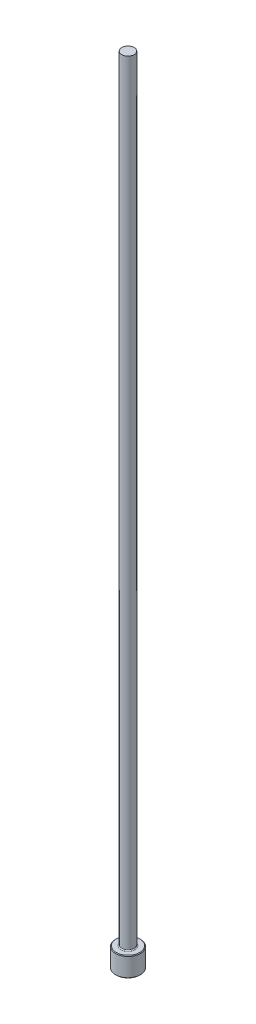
ISO-10303-21;
HEADER;
FILE_DESCRIPTION(('STEP AP214'),'2;1');
FILE_NAME('part.step','',(''),(''),'','','');
FILE_SCHEMA(('AUTOMOTIVE_DESIGN { 1 0 10303 214 1 1 1 1 }'));
ENDSEC;
DATA;
#1=APPLICATION_CONTEXT('core data for automotive mechanical design processes');
#2=APPLICATION_PROTOCOL_DEFINITION('international standard','automotive_design',2000,#1);
#3=PRODUCT_CONTEXT('',#1,'mechanical');
#4=PRODUCT('Part','Part','',(#3));
#5=PRODUCT_RELATED_PRODUCT_CATEGORY('part','',(#4));
#6=PRODUCT_DEFINITION_FORMATION('','',#4);
#7=PRODUCT_DEFINITION_CONTEXT('part definition',#1,'design');
#8=PRODUCT_DEFINITION('design','',#6,#7);
#9=PRODUCT_DEFINITION_SHAPE('','',#8);
#10=(LENGTH_UNIT() NAMED_UNIT(*) SI_UNIT(.MILLI.,.METRE.));
#11=(NAMED_UNIT(*) PLANE_ANGLE_UNIT() SI_UNIT($,.RADIAN.));
#12=(NAMED_UNIT(*) SI_UNIT($,.STERADIAN.) SOLID_ANGLE_UNIT());
#13=UNCERTAINTY_MEASURE_WITH_UNIT(LENGTH_MEASURE(1.E-05),#10,'distance_accuracy_value','');
#14=(GEOMETRIC_REPRESENTATION_CONTEXT(3) GLOBAL_UNCERTAINTY_ASSIGNED_CONTEXT((#13)) GLOBAL_UNIT_ASSIGNED_CONTEXT((#10,
#11,#12)) REPRESENTATION_CONTEXT('',''));
#15=CARTESIAN_POINT('',(0.,0.,0.));
#16=DIRECTION('',(0.,0.,1.));
#17=DIRECTION('',(1.,0.,0.));
#18=AXIS2_PLACEMENT_3D('',#15,#16,#17);
#19=CARTESIAN_POINT('',(0.,0.,0.));
#20=DIRECTION('',(0.,-1.,0.));
#21=DIRECTION('',(0.,0.,-1.));
#22=AXIS2_PLACEMENT_3D('',#19,#20,#21);
#23=PLANE('',#22);
#24=CARTESIAN_POINT('',(0.,0.,0.));
#25=DIRECTION('',(0.,-1.,0.));
#26=DIRECTION('',(0.,0.,-1.));
#27=AXIS2_PLACEMENT_3D('',#24,#25,#26);
#28=CIRCLE('',#27,0.939799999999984);
#29=CARTESIAN_POINT('',(0.,0.,0.939799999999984));
#30=VERTEX_POINT('',#29);
#31=EDGE_CURVE('E46',#30,#30,#28,.T.);
#32=ORIENTED_EDGE('',*,*,#31,.T.);
#33=EDGE_LOOP('',(#32));
#34=FACE_BOUND('',#33,.T.);
#35=ADVANCED_FACE('F35',(#34),#23,.T.);
#36=CARTESIAN_POINT('',(0.,259.958771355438,0.));
#37=DIRECTION('',(0.,1.,0.));
#38=DIRECTION('',(0.,0.,1.));
#39=AXIS2_PLACEMENT_3D('',#36,#37,#38);
#40=CYLINDRICAL_SURFACE('',#39,0.990599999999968);
#41=CARTESIAN_POINT('',(0.,1.52399999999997,0.));
#42=DIRECTION('',(0.,1.,0.));
#43=DIRECTION('',(0.,0.,1.));
#44=AXIS2_PLACEMENT_3D('',#41,#42,#43);
#45=CIRCLE('',#44,0.990599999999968);
#46=CARTESIAN_POINT('',(0.,1.52399999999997,0.990599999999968));
#47=VERTEX_POINT('',#46);
#48=EDGE_CURVE('E50',#47,#47,#45,.F.);
#49=ORIENTED_EDGE('',*,*,#48,.T.);
#50=EDGE_LOOP('',(#49));
#51=FACE_BOUND('',#50,.T.);
#52=CARTESIAN_POINT('',(0.,0.050799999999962,0.));
#53=DIRECTION('',(0.,-1.,0.));
#54=DIRECTION('',(0.,0.,-1.));
#55=AXIS2_PLACEMENT_3D('',#52,#53,#54);
#56=CIRCLE('',#55,0.990599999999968);
#57=CARTESIAN_POINT('',(0.,0.050799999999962,0.990599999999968));
#58=VERTEX_POINT('',#57);
#59=EDGE_CURVE('E55',#58,#58,#56,.F.);
#60=ORIENTED_EDGE('',*,*,#59,.T.);
#61=EDGE_LOOP('',(#60));
#62=FACE_BOUND('',#61,.T.);
#63=ADVANCED_FACE('F77',(#51,#62),#40,.T.);
#64=CARTESIAN_POINT('',(-0.990599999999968,1.5748,0.));
#65=DIRECTION('',(0.,1.,0.));
#66=DIRECTION('',(0.,0.,1.));
#67=AXIS2_PLACEMENT_3D('',#64,#65,#66);
#68=PLANE('',#67);
#69=CARTESIAN_POINT('',(0.,1.5748,0.));
#70=DIRECTION('',(0.,1.,0.));
#71=DIRECTION('',(0.,0.,1.));
#72=AXIS2_PLACEMENT_3D('',#69,#70,#71);
#73=CIRCLE('',#72,0.571499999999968);
#74=CARTESIAN_POINT('',(0.,1.5748,0.571499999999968));
#75=VERTEX_POINT('',#74);
#76=EDGE_CURVE('E10',#75,#75,#73,.F.);
#77=ORIENTED_EDGE('',*,*,#76,.T.);
#78=EDGE_LOOP('',(#77));
#79=FACE_BOUND('',#78,.T.);
#80=CARTESIAN_POINT('',(0.,1.5748,0.));
#81=DIRECTION('',(0.,1.,0.));
#82=DIRECTION('',(0.,0.,1.));
#83=AXIS2_PLACEMENT_3D('',#80,#81,#82);
#84=CIRCLE('',#83,0.939799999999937);
#85=CARTESIAN_POINT('',(0.,1.5748,0.939799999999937));
#86=VERTEX_POINT('',#85);
#87=EDGE_CURVE('E58',#86,#86,#84,.T.);
#88=ORIENTED_EDGE('',*,*,#87,.T.);
#89=EDGE_LOOP('',(#88));
#90=FACE_BOUND('',#89,.T.);
#91=ADVANCED_FACE('F69',(#79,#90),#68,.T.);
#92=CARTESIAN_POINT('',(0.,259.958771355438,0.));
#93=DIRECTION('',(0.,1.,0.));
#94=DIRECTION('',(0.,0.,1.));
#95=AXIS2_PLACEMENT_3D('',#92,#93,#94);
#96=CYLINDRICAL_SURFACE('',#95,0.495299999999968);
#97=CARTESIAN_POINT('',(0.,1.65100000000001,0.));
#98=DIRECTION('',(0.,1.,0.));
#99=DIRECTION('',(0.,0.,1.));
#100=AXIS2_PLACEMENT_3D('',#97,#98,#99);
#101=CIRCLE('',#100,0.495299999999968);
#102=CARTESIAN_POINT('',(0.,1.65100000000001,0.495299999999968));
#103=VERTEX_POINT('',#102);
#104=EDGE_CURVE('E42',#103,#103,#101,.T.);
#105=ORIENTED_EDGE('',*,*,#104,.T.);
#106=EDGE_LOOP('',(#105));
#107=FACE_BOUND('',#106,.T.);
#108=CARTESIAN_POINT('',(0.,63.5,0.));
#109=DIRECTION('',(0.,1.,0.));
#110=DIRECTION('',(0.,0.,1.));
#111=AXIS2_PLACEMENT_3D('',#108,#109,#110);
#112=CIRCLE('',#111,0.495299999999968);
#113=CARTESIAN_POINT('',(0.,63.5,0.495299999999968));
#114=VERTEX_POINT('',#113);
#115=EDGE_CURVE('E61',#114,#114,#112,.T.);
#116=ORIENTED_EDGE('',*,*,#115,.F.);
#117=EDGE_LOOP('',(#116));
#118=FACE_BOUND('',#117,.T.);
#119=ADVANCED_FACE('F67',(#107,#118),#96,.T.);
#120=CARTESIAN_POINT('',(-0.495299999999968,63.5,0.));
#121=DIRECTION('',(0.,1.,0.));
#122=DIRECTION('',(0.,0.,1.));
#123=AXIS2_PLACEMENT_3D('',#120,#121,#122);
#124=PLANE('',#123);
#125=ORIENTED_EDGE('',*,*,#115,.T.);
#126=EDGE_LOOP('',(#125));
#127=FACE_BOUND('',#126,.T.);
#128=ADVANCED_FACE('F65',(#127),#124,.T.);
#129=CARTESIAN_POINT('',(0.,1.57479999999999,0.));
#130=DIRECTION('',(0.,-1.,0.));
#131=DIRECTION('',(0.,0.,-1.));
#132=AXIS2_PLACEMENT_3D('',#129,#130,#131);
#133=CONICAL_SURFACE('',#132,0.939799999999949,0.785398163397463);
#134=ORIENTED_EDGE('',*,*,#48,.F.);
#135=EDGE_LOOP('',(#134));
#136=FACE_BOUND('',#135,.T.);
#137=ORIENTED_EDGE('',*,*,#87,.F.);
#138=EDGE_LOOP('',(#137));
#139=FACE_BOUND('',#138,.T.);
#140=ADVANCED_FACE('F75',(#136,#139),#133,.T.);
#141=CARTESIAN_POINT('',(0.,0.050799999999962,0.));
#142=DIRECTION('',(0.,1.,0.));
#143=DIRECTION('',(0.,0.,1.));
#144=AXIS2_PLACEMENT_3D('',#141,#142,#143);
#145=CONICAL_SURFACE('',#144,0.990599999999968,0.785398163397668);
#146=CARTESIAN_POINT('',(0.,0.,0.939799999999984));
#147=CARTESIAN_POINT('',(0.,0.000529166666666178,0.94032916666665));
#148=CARTESIAN_POINT('',(0.,0.00105833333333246,0.940858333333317));
#149=CARTESIAN_POINT('',(0.,0.00211666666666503,0.94191666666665));
#150=CARTESIAN_POINT('',(0.,0.00264583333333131,0.942445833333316));
#151=CARTESIAN_POINT('',(0.,0.00370416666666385,0.943504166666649));
#152=CARTESIAN_POINT('',(0.,0.0042333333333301,0.944033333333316));
#153=CARTESIAN_POINT('',(0.,0.00529166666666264,0.945091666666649));
#154=CARTESIAN_POINT('',(0.,0.00582083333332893,0.945620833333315));
#155=CARTESIAN_POINT('',(0.,0.00687916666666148,0.946679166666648));
#156=CARTESIAN_POINT('',(0.,0.00740833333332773,0.947208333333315));
#157=CARTESIAN_POINT('',(0.,0.00846666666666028,0.948266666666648));
#158=CARTESIAN_POINT('',(0.,0.00899583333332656,0.948795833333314));
#159=CARTESIAN_POINT('',(0.,0.0100541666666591,0.949854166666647));
#160=CARTESIAN_POINT('',(0.,0.0105833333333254,0.950383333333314));
#161=CARTESIAN_POINT('',(0.,0.0116416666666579,0.951441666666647));
#162=CARTESIAN_POINT('',(0.,0.0121708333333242,0.951970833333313));
#163=CARTESIAN_POINT('',(0.,0.0132291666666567,0.953029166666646));
#164=CARTESIAN_POINT('',(0.,0.013758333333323,0.953558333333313));
#165=CARTESIAN_POINT('',(0.,0.0148166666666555,0.954616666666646));
#166=CARTESIAN_POINT('',(0.,0.0153458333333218,0.955145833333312));
#167=CARTESIAN_POINT('',(0.,0.0164041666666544,0.956204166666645));
#168=CARTESIAN_POINT('',(0.,0.0169333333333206,0.956733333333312));
#169=CARTESIAN_POINT('',(0.,0.0179916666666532,0.957791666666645));
#170=CARTESIAN_POINT('',(0.,0.0185208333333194,0.958320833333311));
#171=CARTESIAN_POINT('',(0.,0.019579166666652,0.959379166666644));
#172=CARTESIAN_POINT('',(0.,0.0201083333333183,0.959908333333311));
#173=CARTESIAN_POINT('',(0.,0.0211666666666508,0.960966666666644));
#174=CARTESIAN_POINT('',(0.,0.0216958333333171,0.96149583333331));
#175=CARTESIAN_POINT('',(0.,0.0227541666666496,0.962554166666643));
#176=CARTESIAN_POINT('',(0.,0.0232833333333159,0.96308333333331));
#177=CARTESIAN_POINT('',(0.,0.0243416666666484,0.964141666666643));
#178=CARTESIAN_POINT('',(0.,0.0248708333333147,0.964670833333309));
#179=CARTESIAN_POINT('',(0.,0.0259291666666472,0.965729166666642));
#180=CARTESIAN_POINT('',(0.,0.0264583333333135,0.966258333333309));
#181=CARTESIAN_POINT('',(0.,0.0275166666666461,0.967316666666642));
#182=CARTESIAN_POINT('',(0.,0.0280458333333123,0.967845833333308));
#183=CARTESIAN_POINT('',(0.,0.0291041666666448,0.968904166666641));
#184=CARTESIAN_POINT('',(0.,0.0296333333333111,0.969433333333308));
#185=CARTESIAN_POINT('',(0.,0.0306916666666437,0.970491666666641));
#186=CARTESIAN_POINT('',(0.,0.03122083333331,0.971020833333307));
#187=CARTESIAN_POINT('',(0.,0.0322791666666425,0.97207916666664));
#188=CARTESIAN_POINT('',(0.,0.0328083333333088,0.972608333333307));
#189=CARTESIAN_POINT('',(0.,0.0338666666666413,0.97366666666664));
#190=CARTESIAN_POINT('',(0.,0.0343958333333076,0.974195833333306));
#191=CARTESIAN_POINT('',(0.,0.0354541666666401,0.975254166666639));
#192=CARTESIAN_POINT('',(0.,0.0359833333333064,0.975783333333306));
#193=CARTESIAN_POINT('',(0.,0.0370416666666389,0.976841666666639));
#194=CARTESIAN_POINT('',(0.,0.0375708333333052,0.977370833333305));
#195=CARTESIAN_POINT('',(0.,0.0386291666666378,0.978429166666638));
#196=CARTESIAN_POINT('',(0.,0.039158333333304,0.978958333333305));
#197=CARTESIAN_POINT('',(0.,0.0402166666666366,0.980016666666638));
#198=CARTESIAN_POINT('',(0.,0.0407458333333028,0.980545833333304));
#199=CARTESIAN_POINT('',(0.,0.0418041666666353,0.981604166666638));
#200=CARTESIAN_POINT('',(0.,0.0423333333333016,0.982133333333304));
#201=CARTESIAN_POINT('',(0.,0.0433916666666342,0.983191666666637));
#202=CARTESIAN_POINT('',(0.,0.0439208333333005,0.983720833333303));
#203=CARTESIAN_POINT('',(0.,0.044979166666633,0.984779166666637));
#204=CARTESIAN_POINT('',(0.,0.0455083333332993,0.985308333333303));
#205=CARTESIAN_POINT('',(0.,0.0465666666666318,0.986366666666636));
#206=CARTESIAN_POINT('',(0.,0.0470958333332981,0.986895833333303));
#207=CARTESIAN_POINT('',(0.,0.0481541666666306,0.987954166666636));
#208=CARTESIAN_POINT('',(0.,0.0486833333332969,0.988483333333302));
#209=CARTESIAN_POINT('',(0.,0.0497416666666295,0.989541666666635));
#210=CARTESIAN_POINT('',(0.,0.0502708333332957,0.990070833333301));
#211=CARTESIAN_POINT('',(0.,0.050799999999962,0.990599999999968));
#212=B_SPLINE_CURVE_WITH_KNOTS('',3,(#146,#147,#148,#149,#150,#151,#152,#153,#154,#155,#156,
#157,#158,#159,#160,#161,#162,#163,#164,#165,#166,#167,#168,#169,#170,#171,#172,#173,#174,#175,
#176,#177,#178,#179,#180,#181,#182,#183,#184,#185,#186,#187,#188,#189,#190,#191,#192,#193,#194,
#195,#196,#197,#198,#199,#200,#201,#202,#203,#204,#205,#206,#207,#208,#209,#210,#211),
.UNSPECIFIED.,.F.,.F.,(4,2,2,2,2,2,2,2,2,2,2,2,2,2,2,2,2,2,2,2,2,2,2,2,2,2,2,2,2,2,2,2,4),(0.,
0.00224506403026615,0.00449012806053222,0.00673519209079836,0.00898025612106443,
0.0112253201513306,0.0134703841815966,0.0157154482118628,0.0179605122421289,0.020205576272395,
0.0224506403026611,0.0246957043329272,0.0269407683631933,0.0291858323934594,0.0314308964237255,
0.0336759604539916,0.0359210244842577,0.0381660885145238,0.0404111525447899,0.042656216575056,
0.0449012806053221,0.0471463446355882,0.0493914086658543,0.0516364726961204,0.0538815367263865,
0.0561266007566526,0.0583716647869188,0.0606167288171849,0.0628617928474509,0.065106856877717,
0.0673519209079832,0.0695969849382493,0.0718420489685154),.UNSPECIFIED.);
#213=EDGE_CURVE('BSEAM89',#30,#58,#212,.T.);
#214=ORIENTED_EDGE('',*,*,#31,.F.);
#215=ORIENTED_EDGE('',*,*,#59,.F.);
#216=ORIENTED_EDGE('',*,*,#213,.T.);
#217=ORIENTED_EDGE('',*,*,#213,.F.);
#218=EDGE_LOOP('',(#214,#216,#215,#217));
#219=FACE_BOUND('',#218,.T.);
#220=ADVANCED_FACE('F89',(#219),#145,.T.);
#221=CARTESIAN_POINT('',(0.,1.65100000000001,0.));
#222=DIRECTION('',(0.,1.,0.));
#223=DIRECTION('',(0.,0.,1.));
#224=AXIS2_PLACEMENT_3D('',#221,#222,#223);
#225=TOROIDAL_SURFACE('',#224,0.571499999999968,0.0762);
#226=ORIENTED_EDGE('',*,*,#76,.F.);
#227=EDGE_LOOP('',(#226));
#228=FACE_BOUND('',#227,.T.);
#229=ORIENTED_EDGE('',*,*,#104,.F.);
#230=EDGE_LOOP('',(#229));
#231=FACE_BOUND('',#230,.T.);
#232=ADVANCED_FACE('F37',(#228,#231),#225,.F.);
#233=CLOSED_SHELL('',(#35,#63,#91,#119,#128,#140,#220,#232));
#234=MANIFOLD_SOLID_BREP('B2',#233);
#235=ADVANCED_BREP_SHAPE_REPRESENTATION('',(#18,#234),#14);
#236=SHAPE_DEFINITION_REPRESENTATION(#9,#235);
ENDSEC;
END-ISO-10303-21;
